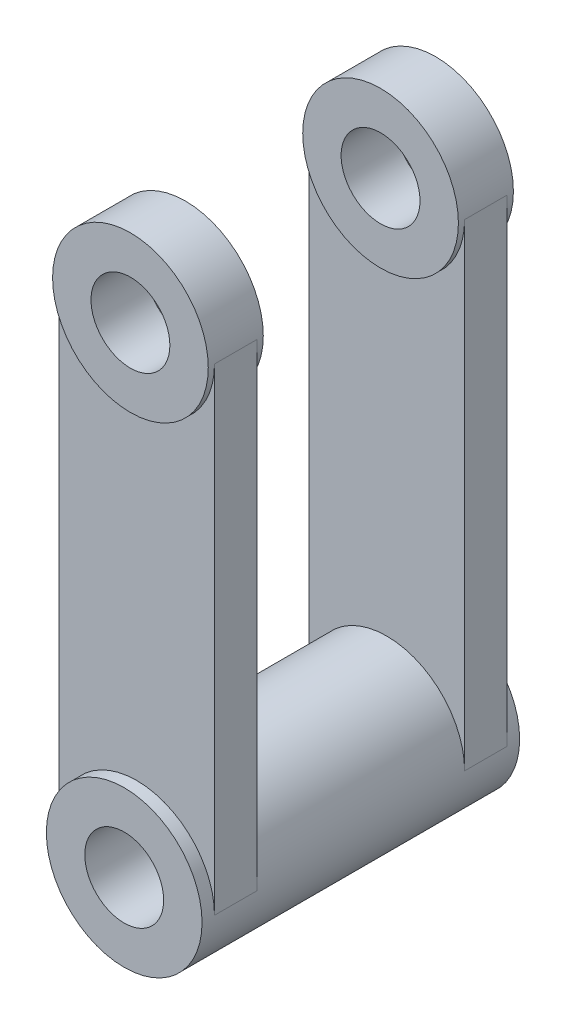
from build123d import *

# Parameters (mm, degrees)
SKETCH1_R           = 75
SKETCH1_R_2         = 38
BOSS_EXTRUDE1_DEPTH = 153
BOSS_EXTRUDE2_START = 141
SKETCH2_R           = 75
SKETCH2_R_2         = 38
BOSS_EXTRUDE2_DEPTH = 41
BOSS_EXTRUDE4_START = 120.5
SKETCH2_4_R         = 75
SKETCH2_4_R_2       = 38
BOSS_EXTRUDE4_DEPTH = 26.5


with BuildPart() as part:
    # Sketch1 → Boss-Extrude1 (new, symmetric)
    with BuildSketch(Plane.XY):
        Circle(SKETCH1_R)
        Circle(SKETCH1_R_2, mode=Mode.SUBTRACT)
    extrude(amount=BOSS_EXTRUDE1_DEPTH, both=True)

    # Sketch2 → Boss-Extrude2 (add)
    # profile 1 of 2: a face of its own
    with BuildSketch(Plane.XY.offset(BOSS_EXTRUDE2_START)):
        with BuildLine():
            ThreePointArc((75, 460), (0, 385), (-75, 460))
            Line((-75, 460), (-75, 0))
            ThreePointArc((-75, 0), (0, 75), (75, 0))
            Line((75, 0), (75, 460))
        make_face()
    # profile 2 of 2: a face of its own
    with BuildSketch(Plane.XY.offset(BOSS_EXTRUDE2_START)):
        with Locations((0, 460)):
            Circle(SKETCH2_R)
        with Locations((0, 460)):
            Circle(SKETCH2_R_2, mode=Mode.SUBTRACT)
    boss_extrude2 = extrude(amount=-BOSS_EXTRUDE2_DEPTH)

    # Sketch2_4 → Boss-Extrude4 (add, symmetric)
    with BuildSketch(Plane.XY.offset(BOSS_EXTRUDE4_START)):
        with Locations((0, 460)):
            Circle(SKETCH2_4_R)
        with Locations((0, 460)):
            Circle(SKETCH2_4_R_2, mode=Mode.SUBTRACT)
    boss_extrude4 = extrude(amount=BOSS_EXTRUDE4_DEPTH, both=True)

    # Mirror2: Boss-Extrude2, Boss-Extrude4 across plane
    add(boss_extrude2.mirror(Plane.XY))
    add(boss_extrude4.mirror(Plane.XY))


solid = part.part
